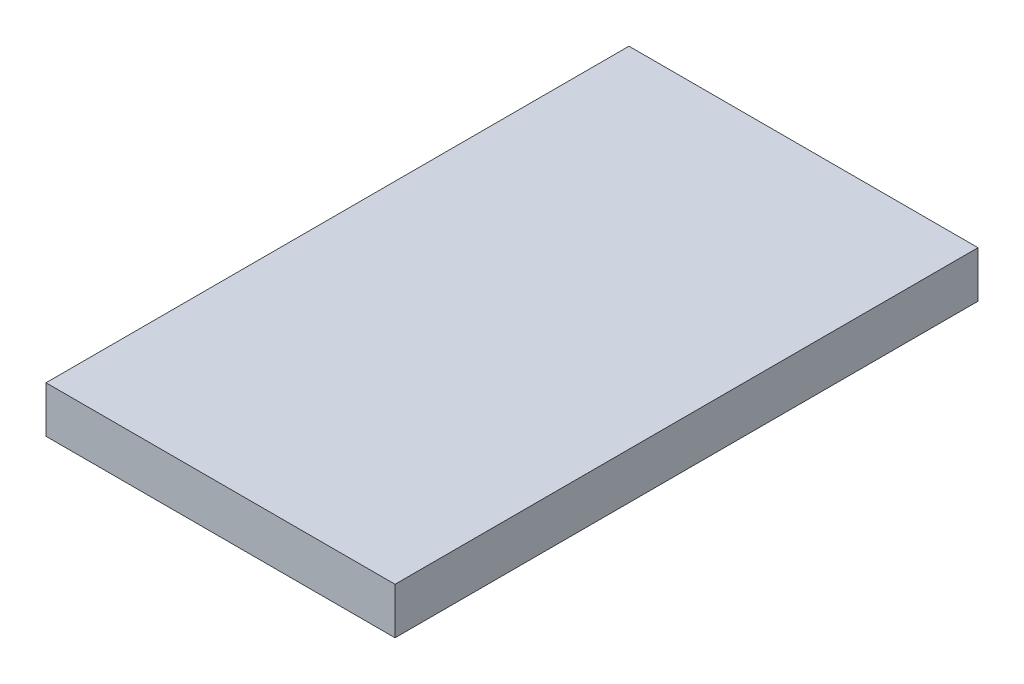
ISO-10303-21;
HEADER;
FILE_DESCRIPTION(('STEP AP214'),'2;1');
FILE_NAME('part.step','',(''),(''),'','','');
FILE_SCHEMA(('AUTOMOTIVE_DESIGN { 1 0 10303 214 1 1 1 1 }'));
ENDSEC;
DATA;
#1=APPLICATION_CONTEXT('core data for automotive mechanical design processes');
#2=APPLICATION_PROTOCOL_DEFINITION('international standard','automotive_design',2000,#1);
#3=PRODUCT_CONTEXT('',#1,'mechanical');
#4=PRODUCT('Part','Part','',(#3));
#5=PRODUCT_RELATED_PRODUCT_CATEGORY('part','',(#4));
#6=PRODUCT_DEFINITION_FORMATION('','',#4);
#7=PRODUCT_DEFINITION_CONTEXT('part definition',#1,'design');
#8=PRODUCT_DEFINITION('design','',#6,#7);
#9=PRODUCT_DEFINITION_SHAPE('','',#8);
#10=(LENGTH_UNIT() NAMED_UNIT(*) SI_UNIT(.MILLI.,.METRE.));
#11=(NAMED_UNIT(*) PLANE_ANGLE_UNIT() SI_UNIT($,.RADIAN.));
#12=(NAMED_UNIT(*) SI_UNIT($,.STERADIAN.) SOLID_ANGLE_UNIT());
#13=UNCERTAINTY_MEASURE_WITH_UNIT(LENGTH_MEASURE(1.E-05),#10,'distance_accuracy_value','');
#14=(GEOMETRIC_REPRESENTATION_CONTEXT(3) GLOBAL_UNCERTAINTY_ASSIGNED_CONTEXT((#13)) GLOBAL_UNIT_ASSIGNED_CONTEXT((#10,
#11,#12)) REPRESENTATION_CONTEXT('',''));
#15=CARTESIAN_POINT('',(0.,0.,0.));
#16=DIRECTION('',(0.,0.,1.));
#17=DIRECTION('',(1.,0.,0.));
#18=AXIS2_PLACEMENT_3D('',#15,#16,#17);
#19=CARTESIAN_POINT('',(60.2,15.9999999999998,-100.55));
#20=DIRECTION('',(-1.,0.,0.));
#21=DIRECTION('',(0.,0.,1.));
#22=AXIS2_PLACEMENT_3D('',#19,#20,#21);
#23=PLANE('',#22);
#24=DIRECTION('',(0.,0.,-1.));
#25=VECTOR('',#24,1.);
#26=CARTESIAN_POINT('',(60.2,0.,-100.55));
#27=LINE('',#26,#25);
#28=CARTESIAN_POINT('',(60.2,0.,100.55));
#29=VERTEX_POINT('',#28);
#30=CARTESIAN_POINT('',(60.2,0.,-100.55));
#31=VERTEX_POINT('',#30);
#32=EDGE_CURVE('E107',#29,#31,#27,.T.);
#33=ORIENTED_EDGE('',*,*,#32,.T.);
#34=DIRECTION('',(0.,-1.,0.));
#35=VECTOR('',#34,1.);
#36=CARTESIAN_POINT('',(60.2,15.9999999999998,-100.55));
#37=LINE('',#36,#35);
#38=CARTESIAN_POINT('',(60.2,15.9999999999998,-100.55));
#39=VERTEX_POINT('',#38);
#40=EDGE_CURVE('E13',#39,#31,#37,.T.);
#41=ORIENTED_EDGE('',*,*,#40,.F.);
#42=DIRECTION('',(0.,0.,-1.));
#43=VECTOR('',#42,1.);
#44=CARTESIAN_POINT('',(60.2,15.9999999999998,-100.55));
#45=LINE('',#44,#43);
#46=CARTESIAN_POINT('',(60.2,16.0000000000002,100.55));
#47=VERTEX_POINT('',#46);
#48=EDGE_CURVE('E95',#47,#39,#45,.T.);
#49=ORIENTED_EDGE('',*,*,#48,.F.);
#50=DIRECTION('',(0.,-1.,0.));
#51=VECTOR('',#50,1.);
#52=CARTESIAN_POINT('',(60.2,16.0000000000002,100.55));
#53=LINE('',#52,#51);
#54=EDGE_CURVE('E103',#47,#29,#53,.T.);
#55=ORIENTED_EDGE('',*,*,#54,.T.);
#56=EDGE_LOOP('',(#33,#41,#49,#55));
#57=FACE_BOUND('',#56,.T.);
#58=ADVANCED_FACE('F44',(#57),#23,.F.);
#59=CARTESIAN_POINT('',(-60.2,15.9999999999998,-100.55));
#60=DIRECTION('',(0.,0.,1.));
#61=DIRECTION('',(1.,0.,0.));
#62=AXIS2_PLACEMENT_3D('',#59,#60,#61);
#63=PLANE('',#62);
#64=DIRECTION('',(-1.,0.,0.));
#65=VECTOR('',#64,1.);
#66=CARTESIAN_POINT('',(-60.2,0.,-100.55));
#67=LINE('',#66,#65);
#68=CARTESIAN_POINT('',(-60.2,0.,-100.55));
#69=VERTEX_POINT('',#68);
#70=EDGE_CURVE('E99',#31,#69,#67,.T.);
#71=ORIENTED_EDGE('',*,*,#70,.T.);
#72=DIRECTION('',(0.,-1.,0.));
#73=VECTOR('',#72,1.);
#74=CARTESIAN_POINT('',(-60.2,15.9999999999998,-100.55));
#75=LINE('',#74,#73);
#76=CARTESIAN_POINT('',(-60.2,15.9999999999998,-100.55));
#77=VERTEX_POINT('',#76);
#78=EDGE_CURVE('E52',#77,#69,#75,.T.);
#79=ORIENTED_EDGE('',*,*,#78,.F.);
#80=DIRECTION('',(-1.,0.,0.));
#81=VECTOR('',#80,1.);
#82=CARTESIAN_POINT('',(-60.2,15.9999999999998,-100.55));
#83=LINE('',#82,#81);
#84=EDGE_CURVE('E90',#39,#77,#83,.T.);
#85=ORIENTED_EDGE('',*,*,#84,.F.);
#86=ORIENTED_EDGE('',*,*,#40,.T.);
#87=EDGE_LOOP('',(#71,#79,#85,#86));
#88=FACE_BOUND('',#87,.T.);
#89=ADVANCED_FACE('F98',(#88),#63,.F.);
#90=CARTESIAN_POINT('',(-60.2,15.9999999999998,-100.55));
#91=DIRECTION('',(1.,0.,0.));
#92=DIRECTION('',(0.,0.,-1.));
#93=AXIS2_PLACEMENT_3D('',#90,#91,#92);
#94=PLANE('',#93);
#95=DIRECTION('',(0.,0.,1.));
#96=VECTOR('',#95,1.);
#97=CARTESIAN_POINT('',(-60.2,0.,-100.55));
#98=LINE('',#97,#96);
#99=CARTESIAN_POINT('',(-60.2,0.,100.55));
#100=VERTEX_POINT('',#99);
#101=EDGE_CURVE('E77',#69,#100,#98,.T.);
#102=ORIENTED_EDGE('',*,*,#101,.T.);
#103=DIRECTION('',(0.,-1.,0.));
#104=VECTOR('',#103,1.);
#105=CARTESIAN_POINT('',(-60.2,16.0000000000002,100.55));
#106=LINE('',#105,#104);
#107=CARTESIAN_POINT('',(-60.2,16.0000000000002,100.55));
#108=VERTEX_POINT('',#107);
#109=EDGE_CURVE('E100',#108,#100,#106,.T.);
#110=ORIENTED_EDGE('',*,*,#109,.F.);
#111=DIRECTION('',(0.,0.,1.));
#112=VECTOR('',#111,1.);
#113=CARTESIAN_POINT('',(-60.2,15.9999999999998,-100.55));
#114=LINE('',#113,#112);
#115=EDGE_CURVE('E93',#77,#108,#114,.T.);
#116=ORIENTED_EDGE('',*,*,#115,.F.);
#117=ORIENTED_EDGE('',*,*,#78,.T.);
#118=EDGE_LOOP('',(#102,#110,#116,#117));
#119=FACE_BOUND('',#118,.T.);
#120=ADVANCED_FACE('F101',(#119),#94,.F.);
#121=CARTESIAN_POINT('',(-60.2,16.0000000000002,100.55));
#122=DIRECTION('',(0.,0.,-1.));
#123=DIRECTION('',(-1.,0.,0.));
#124=AXIS2_PLACEMENT_3D('',#121,#122,#123);
#125=PLANE('',#124);
#126=DIRECTION('',(1.,0.,0.));
#127=VECTOR('',#126,1.);
#128=CARTESIAN_POINT('',(-60.2,0.,100.55));
#129=LINE('',#128,#127);
#130=EDGE_CURVE('E83',#100,#29,#129,.T.);
#131=ORIENTED_EDGE('',*,*,#130,.T.);
#132=ORIENTED_EDGE('',*,*,#54,.F.);
#133=DIRECTION('',(1.,0.,0.));
#134=VECTOR('',#133,1.);
#135=CARTESIAN_POINT('',(-60.2,16.0000000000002,100.55));
#136=LINE('',#135,#134);
#137=EDGE_CURVE('E60',#108,#47,#136,.T.);
#138=ORIENTED_EDGE('',*,*,#137,.F.);
#139=ORIENTED_EDGE('',*,*,#109,.T.);
#140=EDGE_LOOP('',(#131,#132,#138,#139));
#141=FACE_BOUND('',#140,.T.);
#142=ADVANCED_FACE('F115',(#141),#125,.F.);
#143=CARTESIAN_POINT('',(60.2,16.0000000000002,100.55));
#144=DIRECTION('',(0.,1.,0.));
#145=DIRECTION('',(0.,0.,1.));
#146=AXIS2_PLACEMENT_3D('',#143,#144,#145);
#147=PLANE('',#146);
#148=ORIENTED_EDGE('',*,*,#48,.T.);
#149=ORIENTED_EDGE('',*,*,#84,.T.);
#150=ORIENTED_EDGE('',*,*,#115,.T.);
#151=ORIENTED_EDGE('',*,*,#137,.T.);
#152=EDGE_LOOP('',(#148,#149,#150,#151));
#153=FACE_BOUND('',#152,.T.);
#154=ADVANCED_FACE('F91',(#153),#147,.T.);
#155=CARTESIAN_POINT('',(60.2,0.,100.55));
#156=DIRECTION('',(0.,1.,0.));
#157=DIRECTION('',(0.,0.,1.));
#158=AXIS2_PLACEMENT_3D('',#155,#156,#157);
#159=PLANE('',#158);
#160=CARTESIAN_POINT('',(-35.,0.,-50.85));
#161=DIRECTION('',(0.,-1.,0.));
#162=DIRECTION('',(0.,0.,-1.));
#163=AXIS2_PLACEMENT_3D('',#160,#161,#162);
#164=CIRCLE('',#163,3.09999999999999);
#165=CARTESIAN_POINT('',(-35.,0.,-53.95));
#166=VERTEX_POINT('',#165);
#167=EDGE_CURVE('E139',#166,#166,#164,.T.);
#168=ORIENTED_EDGE('',*,*,#167,.F.);
#169=EDGE_LOOP('',(#168));
#170=FACE_BOUND('',#169,.T.);
#171=CARTESIAN_POINT('',(35.,0.,-50.85));
#172=DIRECTION('',(0.,-1.,0.));
#173=DIRECTION('',(0.,0.,-1.));
#174=AXIS2_PLACEMENT_3D('',#171,#172,#173);
#175=CIRCLE('',#174,3.09999999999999);
#176=CARTESIAN_POINT('',(35.,0.,-53.95));
#177=VERTEX_POINT('',#176);
#178=EDGE_CURVE('E133',#177,#177,#175,.T.);
#179=ORIENTED_EDGE('',*,*,#178,.F.);
#180=EDGE_LOOP('',(#179));
#181=FACE_BOUND('',#180,.T.);
#182=CARTESIAN_POINT('',(35.,0.,50.85));
#183=DIRECTION('',(0.,-1.,0.));
#184=DIRECTION('',(0.,0.,-1.));
#185=AXIS2_PLACEMENT_3D('',#182,#183,#184);
#186=CIRCLE('',#185,3.09999999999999);
#187=CARTESIAN_POINT('',(35.,0.,47.75));
#188=VERTEX_POINT('',#187);
#189=EDGE_CURVE('E127',#188,#188,#186,.T.);
#190=ORIENTED_EDGE('',*,*,#189,.F.);
#191=EDGE_LOOP('',(#190));
#192=FACE_BOUND('',#191,.T.);
#193=CARTESIAN_POINT('',(-35.,0.,50.85));
#194=DIRECTION('',(0.,-1.,0.));
#195=DIRECTION('',(0.,0.,-1.));
#196=AXIS2_PLACEMENT_3D('',#193,#194,#195);
#197=CIRCLE('',#196,3.09999999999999);
#198=CARTESIAN_POINT('',(-35.,0.,47.75));
#199=VERTEX_POINT('',#198);
#200=EDGE_CURVE('E121',#199,#199,#197,.T.);
#201=ORIENTED_EDGE('',*,*,#200,.F.);
#202=EDGE_LOOP('',(#201));
#203=FACE_BOUND('',#202,.T.);
#204=ORIENTED_EDGE('',*,*,#32,.F.);
#205=ORIENTED_EDGE('',*,*,#130,.F.);
#206=ORIENTED_EDGE('',*,*,#101,.F.);
#207=ORIENTED_EDGE('',*,*,#70,.F.);
#208=EDGE_LOOP('',(#204,#205,#206,#207));
#209=FACE_BOUND('',#208,.T.);
#210=ADVANCED_FACE('F118',(#170,#181,#192,#203,#209),#159,.F.);
#211=CARTESIAN_POINT('',(-35.,5.,50.85));
#212=DIRECTION('',(0.,-1.,0.));
#213=DIRECTION('',(0.,0.,-1.));
#214=AXIS2_PLACEMENT_3D('',#211,#212,#213);
#215=CYLINDRICAL_SURFACE('',#214,3.09999999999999);
#216=CARTESIAN_POINT('',(-35.,5.,50.85));
#217=DIRECTION('',(0.,-1.,0.));
#218=DIRECTION('',(0.,0.,-1.));
#219=AXIS2_PLACEMENT_3D('',#216,#217,#218);
#220=CIRCLE('',#219,3.09999999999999);
#221=CARTESIAN_POINT('',(-35.,5.,47.75));
#222=VERTEX_POINT('',#221);
#223=EDGE_CURVE('E110',#222,#222,#220,.T.);
#224=ORIENTED_EDGE('',*,*,#223,.F.);
#225=EDGE_LOOP('',(#224));
#226=FACE_BOUND('',#225,.T.);
#227=ORIENTED_EDGE('',*,*,#200,.T.);
#228=EDGE_LOOP('',(#227));
#229=FACE_BOUND('',#228,.T.);
#230=ADVANCED_FACE('F156',(#226,#229),#215,.F.);
#231=CARTESIAN_POINT('',(-35.,5.,50.85));
#232=DIRECTION('',(0.,-1.,0.));
#233=DIRECTION('',(0.,0.,-1.));
#234=AXIS2_PLACEMENT_3D('',#231,#232,#233);
#235=PLANE('',#234);
#236=ORIENTED_EDGE('',*,*,#223,.T.);
#237=EDGE_LOOP('',(#236));
#238=FACE_BOUND('',#237,.T.);
#239=ADVANCED_FACE('F165',(#238),#235,.T.);
#240=CARTESIAN_POINT('',(35.,5.,50.85));
#241=DIRECTION('',(0.,-1.,0.));
#242=DIRECTION('',(0.,0.,-1.));
#243=AXIS2_PLACEMENT_3D('',#240,#241,#242);
#244=CYLINDRICAL_SURFACE('',#243,3.09999999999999);
#245=CARTESIAN_POINT('',(35.,5.,50.85));
#246=DIRECTION('',(0.,-1.,0.));
#247=DIRECTION('',(0.,0.,-1.));
#248=AXIS2_PLACEMENT_3D('',#245,#246,#247);
#249=CIRCLE('',#248,3.09999999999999);
#250=CARTESIAN_POINT('',(35.,5.,47.75));
#251=VERTEX_POINT('',#250);
#252=EDGE_CURVE('E124',#251,#251,#249,.T.);
#253=ORIENTED_EDGE('',*,*,#252,.F.);
#254=EDGE_LOOP('',(#253));
#255=FACE_BOUND('',#254,.T.);
#256=ORIENTED_EDGE('',*,*,#189,.T.);
#257=EDGE_LOOP('',(#256));
#258=FACE_BOUND('',#257,.T.);
#259=ADVANCED_FACE('F171',(#255,#258),#244,.F.);
#260=CARTESIAN_POINT('',(35.,5.,50.85));
#261=DIRECTION('',(0.,-1.,0.));
#262=DIRECTION('',(0.,0.,-1.));
#263=AXIS2_PLACEMENT_3D('',#260,#261,#262);
#264=PLANE('',#263);
#265=ORIENTED_EDGE('',*,*,#252,.T.);
#266=EDGE_LOOP('',(#265));
#267=FACE_BOUND('',#266,.T.);
#268=ADVANCED_FACE('F208',(#267),#264,.T.);
#269=CARTESIAN_POINT('',(35.,4.99999999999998,-50.85));
#270=DIRECTION('',(0.,-1.,0.));
#271=DIRECTION('',(0.,0.,-1.));
#272=AXIS2_PLACEMENT_3D('',#269,#270,#271);
#273=CYLINDRICAL_SURFACE('',#272,3.09999999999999);
#274=CARTESIAN_POINT('',(35.,4.99999999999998,-50.85));
#275=DIRECTION('',(0.,-1.,0.));
#276=DIRECTION('',(0.,0.,-1.));
#277=AXIS2_PLACEMENT_3D('',#274,#275,#276);
#278=CIRCLE('',#277,3.09999999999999);
#279=CARTESIAN_POINT('',(35.,4.99999999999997,-53.95));
#280=VERTEX_POINT('',#279);
#281=EDGE_CURVE('E130',#280,#280,#278,.T.);
#282=ORIENTED_EDGE('',*,*,#281,.F.);
#283=EDGE_LOOP('',(#282));
#284=FACE_BOUND('',#283,.T.);
#285=ORIENTED_EDGE('',*,*,#178,.T.);
#286=EDGE_LOOP('',(#285));
#287=FACE_BOUND('',#286,.T.);
#288=ADVANCED_FACE('F216',(#284,#287),#273,.F.);
#289=CARTESIAN_POINT('',(35.,4.99999999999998,-50.85));
#290=DIRECTION('',(0.,-1.,0.));
#291=DIRECTION('',(0.,0.,-1.));
#292=AXIS2_PLACEMENT_3D('',#289,#290,#291);
#293=PLANE('',#292);
#294=ORIENTED_EDGE('',*,*,#281,.T.);
#295=EDGE_LOOP('',(#294));
#296=FACE_BOUND('',#295,.T.);
#297=ADVANCED_FACE('F150',(#296),#293,.T.);
#298=CARTESIAN_POINT('',(-35.,4.99999999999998,-50.85));
#299=DIRECTION('',(0.,-1.,0.));
#300=DIRECTION('',(0.,0.,-1.));
#301=AXIS2_PLACEMENT_3D('',#298,#299,#300);
#302=CYLINDRICAL_SURFACE('',#301,3.09999999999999);
#303=CARTESIAN_POINT('',(-35.,4.99999999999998,-50.85));
#304=DIRECTION('',(0.,-1.,0.));
#305=DIRECTION('',(0.,0.,-1.));
#306=AXIS2_PLACEMENT_3D('',#303,#304,#305);
#307=CIRCLE('',#306,3.09999999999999);
#308=CARTESIAN_POINT('',(-35.,4.99999999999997,-53.95));
#309=VERTEX_POINT('',#308);
#310=EDGE_CURVE('E136',#309,#309,#307,.T.);
#311=ORIENTED_EDGE('',*,*,#310,.F.);
#312=EDGE_LOOP('',(#311));
#313=FACE_BOUND('',#312,.T.);
#314=ORIENTED_EDGE('',*,*,#167,.T.);
#315=EDGE_LOOP('',(#314));
#316=FACE_BOUND('',#315,.T.);
#317=ADVANCED_FACE('F147',(#313,#316),#302,.F.);
#318=CARTESIAN_POINT('',(-35.,4.99999999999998,-50.85));
#319=DIRECTION('',(0.,-1.,0.));
#320=DIRECTION('',(0.,0.,-1.));
#321=AXIS2_PLACEMENT_3D('',#318,#319,#320);
#322=PLANE('',#321);
#323=ORIENTED_EDGE('',*,*,#310,.T.);
#324=EDGE_LOOP('',(#323));
#325=FACE_BOUND('',#324,.T.);
#326=ADVANCED_FACE('F145',(#325),#322,.T.);
#327=CLOSED_SHELL('',(#58,#89,#120,#142,#154,#210,#230,#239,#259,#268,#288,#297,#317,#326));
#328=MANIFOLD_SOLID_BREP('B2',#327);
#329=ADVANCED_BREP_SHAPE_REPRESENTATION('',(#18,#328),#14);
#330=SHAPE_DEFINITION_REPRESENTATION(#9,#329);
ENDSEC;
END-ISO-10303-21;
